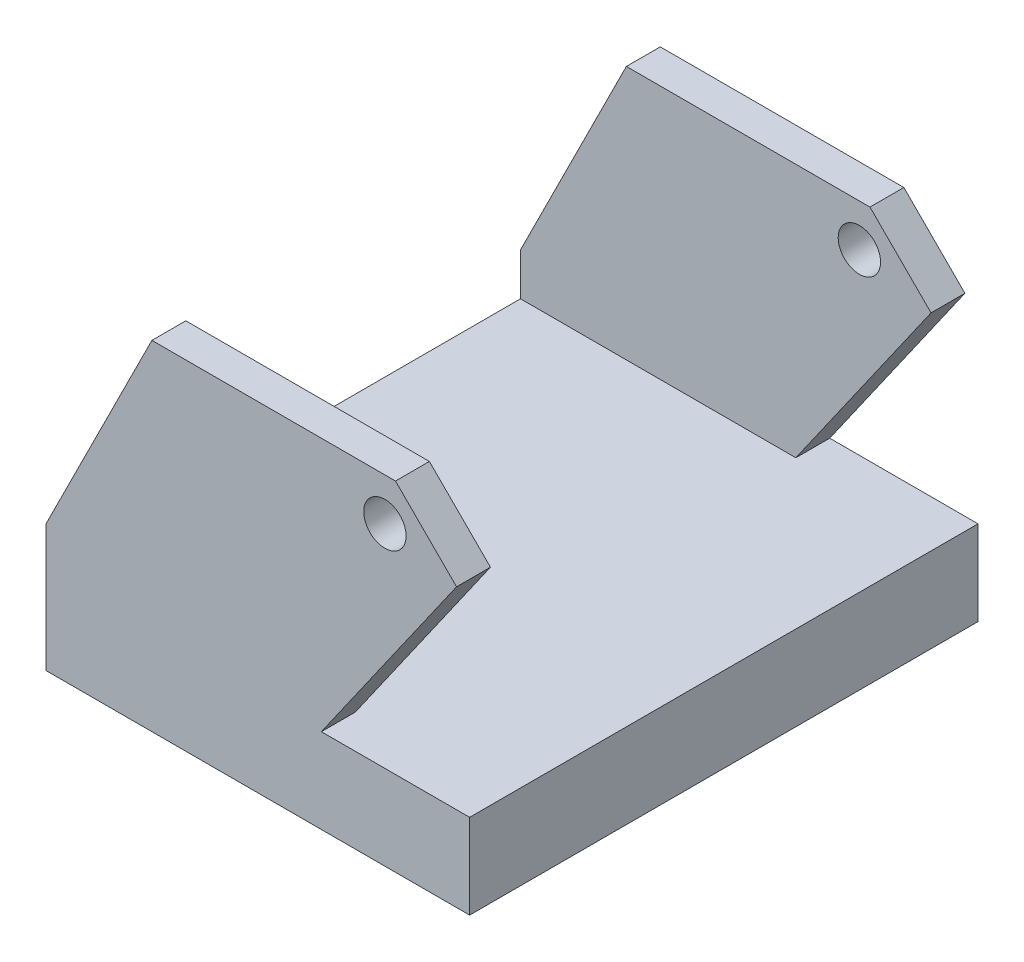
from build123d import *

# Parameters (mm, degrees)
BOSS_EXTRUDE1_DEPTH     = 50
CUT_EXTRUDE1_DEPTH      = 112.803398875
CUT_EXTRUDE1_DEPTH_BACK = 112.803398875
SKETCH2_R               = 5


with BuildPart() as part:
    # Sketch1 → Boss-Extrude1 (new, symmetric)
    with BuildSketch(Plane(origin=(0, 0, 0), x_dir=(0, 0, -1), z_dir=(1, 0, 0))):
        Polygon((-60, 0), (60, 0), (60, 80), (52, 80), (52, 20), (-52, 20), (-52, 80), (-60, 80), align=None)
    extrude(amount=BOSS_EXTRUDE1_DEPTH, both=True)

    # Sketch2 → Cut-Extrude1 (cut, two sides: drawn at the far end of the back side and taken through both)
    with BuildSketch(Plane.XY.offset(-CUT_EXTRUDE1_DEPTH_BACK)):
        with Locations((30, 70)):
            Circle(SKETCH2_R)
        Polygon((-25, 80), (-50, 30), (-50, 80), align=None)
        Polygon((46.917329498, 65.582670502), (15, 20), (50, 20), (50, 69.985180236), (50, 80), (32.5, 80), align=None)
    extrude(amount=CUT_EXTRUDE1_DEPTH + CUT_EXTRUDE1_DEPTH_BACK, mode=Mode.SUBTRACT)


solid = part.part
